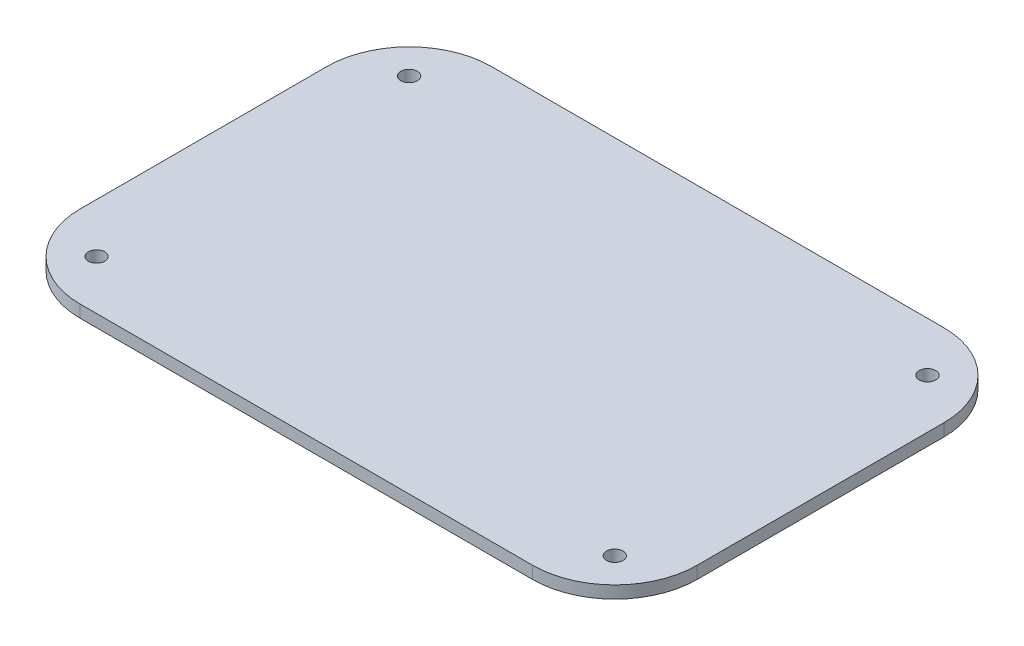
from build123d import *

# Parameters (mm, degrees)
BOSS_EXTRUDE1_DEPTH     = 3
SKETCH3_R               = 2
CUT_EXTRUDE1_DEPTH      = 10
MIRROR2_COPY_1_SKETCH_R = 2
MIRROR2_COPY_1_DEPTH    = 10


with BuildPart() as part:
    # Sketch1 → Boss-Extrude1 (new body)
    with BuildSketch(Plane(origin=(0, 0, 0), x_dir=(1, 0, 0), z_dir=(0, 1, 0))):
        with BuildLine():
            Line((-55, 50), (55, 50))
            ThreePointArc((55, 50), (69.142135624, 44.142135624), (75, 30))
            Line((75, 30), (75, -30))
            ThreePointArc((75, -30), (69.142135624, -44.142135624), (55, -50))
            Line((55, -50), (-55, -50))
            ThreePointArc((-55, -50), (-69.142135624, -44.142135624), (-75, -30))
            Line((-75, -30), (-75, 30))
            ThreePointArc((-75, 30), (-69.142135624, 44.142135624), (-55, 50))
        make_face()
    extrude(amount=BOSS_EXTRUDE1_DEPTH)

    # Sketch3 → Cut-Extrude1 (cut)
    with BuildSketch(Plane(origin=(0, 3, 0), x_dir=(1, 0, 0), z_dir=(0, 1, 0))):
        with Locations(Location((63, 38, 0), (0, 0, 270))):
            Circle(SKETCH3_R)
    cut_extrude1 = extrude(amount=-CUT_EXTRUDE1_DEPTH, mode=Mode.SUBTRACT)

    # Mirror1: Cut-Extrude1 across plane
    add(cut_extrude1.mirror(Plane.XY), mode=Mode.SUBTRACT)

    # Mirror2: Cut-Extrude1 across plane
    add(cut_extrude1.mirror(Plane(origin=(0, 0, 0), x_dir=(0, 0, 1), z_dir=(1, 0, 0))), mode=Mode.SUBTRACT)

    # Mirror2 copy 1 sketch → Mirror2 copy 1 (cut)
    with BuildSketch(Plane(origin=(0, 3, 0), x_dir=(-1, 0, 0), z_dir=(0, 1, 0))):
        with Locations(Location((63, 38, 0), (0, 0, 270))):
            Circle(MIRROR2_COPY_1_SKETCH_R)
    extrude(amount=-MIRROR2_COPY_1_DEPTH, mode=Mode.SUBTRACT)


solid = part.part
